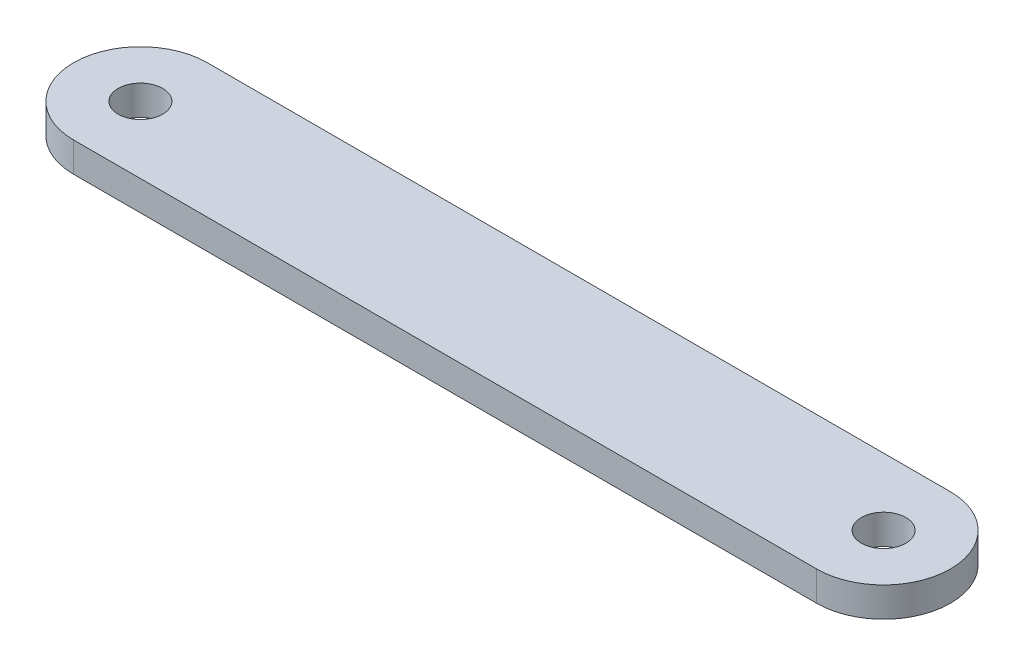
ISO-10303-21;
HEADER;
FILE_DESCRIPTION(('STEP AP214'),'2;1');
FILE_NAME('part.step','',(''),(''),'','','');
FILE_SCHEMA(('AUTOMOTIVE_DESIGN { 1 0 10303 214 1 1 1 1 }'));
ENDSEC;
DATA;
#1=APPLICATION_CONTEXT('core data for automotive mechanical design processes');
#2=APPLICATION_PROTOCOL_DEFINITION('international standard','automotive_design',2000,#1);
#3=PRODUCT_CONTEXT('',#1,'mechanical');
#4=PRODUCT('Part','Part','',(#3));
#5=PRODUCT_RELATED_PRODUCT_CATEGORY('part','',(#4));
#6=PRODUCT_DEFINITION_FORMATION('','',#4);
#7=PRODUCT_DEFINITION_CONTEXT('part definition',#1,'design');
#8=PRODUCT_DEFINITION('design','',#6,#7);
#9=PRODUCT_DEFINITION_SHAPE('','',#8);
#10=(LENGTH_UNIT() NAMED_UNIT(*) SI_UNIT(.MILLI.,.METRE.));
#11=(NAMED_UNIT(*) PLANE_ANGLE_UNIT() SI_UNIT($,.RADIAN.));
#12=(NAMED_UNIT(*) SI_UNIT($,.STERADIAN.) SOLID_ANGLE_UNIT());
#13=UNCERTAINTY_MEASURE_WITH_UNIT(LENGTH_MEASURE(1.E-05),#10,'distance_accuracy_value','');
#14=(GEOMETRIC_REPRESENTATION_CONTEXT(3) GLOBAL_UNCERTAINTY_ASSIGNED_CONTEXT((#13)) GLOBAL_UNIT_ASSIGNED_CONTEXT((#10,
#11,#12)) REPRESENTATION_CONTEXT('',''));
#15=CARTESIAN_POINT('',(0.,0.,0.));
#16=DIRECTION('',(0.,0.,1.));
#17=DIRECTION('',(1.,0.,0.));
#18=AXIS2_PLACEMENT_3D('',#15,#16,#17);
#19=CARTESIAN_POINT('',(25.,2.,0.));
#20=DIRECTION('',(0.,-1.,0.));
#21=DIRECTION('',(0.,0.,-1.));
#22=AXIS2_PLACEMENT_3D('',#19,#20,#21);
#23=CYLINDRICAL_SURFACE('',#22,4.5);
#24=CARTESIAN_POINT('',(25.,0.,0.));
#25=DIRECTION('',(0.,1.,0.));
#26=DIRECTION('',(0.,0.,-1.));
#27=AXIS2_PLACEMENT_3D('',#24,#25,#26);
#28=CIRCLE('',#27,4.5);
#29=CARTESIAN_POINT('',(25.,0.,4.5));
#30=VERTEX_POINT('',#29);
#31=CARTESIAN_POINT('',(25.,0.,-4.5));
#32=VERTEX_POINT('',#31);
#33=EDGE_CURVE('E118',#30,#32,#28,.T.);
#34=ORIENTED_EDGE('',*,*,#33,.T.);
#35=DIRECTION('',(0.,-1.,0.));
#36=VECTOR('',#35,1.);
#37=CARTESIAN_POINT('',(25.,2.,-4.5));
#38=LINE('',#37,#36);
#39=CARTESIAN_POINT('',(25.,2.,-4.5));
#40=VERTEX_POINT('',#39);
#41=EDGE_CURVE('E13',#40,#32,#38,.T.);
#42=ORIENTED_EDGE('',*,*,#41,.F.);
#43=CARTESIAN_POINT('',(25.,2.,0.));
#44=DIRECTION('',(0.,1.,0.));
#45=DIRECTION('',(0.,0.,-1.));
#46=AXIS2_PLACEMENT_3D('',#43,#44,#45);
#47=CIRCLE('',#46,4.5);
#48=CARTESIAN_POINT('',(25.,2.,4.5));
#49=VERTEX_POINT('',#48);
#50=EDGE_CURVE('E102',#49,#40,#47,.T.);
#51=ORIENTED_EDGE('',*,*,#50,.F.);
#52=DIRECTION('',(0.,-1.,0.));
#53=VECTOR('',#52,1.);
#54=CARTESIAN_POINT('',(25.,2.,4.5));
#55=LINE('',#54,#53);
#56=EDGE_CURVE('E114',#49,#30,#55,.T.);
#57=ORIENTED_EDGE('',*,*,#56,.T.);
#58=EDGE_LOOP('',(#34,#42,#51,#57));
#59=FACE_BOUND('',#58,.T.);
#60=ADVANCED_FACE('F50',(#59),#23,.T.);
#61=CARTESIAN_POINT('',(-25.,2.,-4.5));
#62=DIRECTION('',(0.,0.,1.));
#63=DIRECTION('',(1.,0.,0.));
#64=AXIS2_PLACEMENT_3D('',#61,#62,#63);
#65=PLANE('',#64);
#66=DIRECTION('',(-1.,0.,0.));
#67=VECTOR('',#66,1.);
#68=CARTESIAN_POINT('',(-25.,0.,-4.5));
#69=LINE('',#68,#67);
#70=CARTESIAN_POINT('',(-25.,0.,-4.5));
#71=VERTEX_POINT('',#70);
#72=EDGE_CURVE('E107',#32,#71,#69,.T.);
#73=ORIENTED_EDGE('',*,*,#72,.T.);
#74=DIRECTION('',(0.,-1.,0.));
#75=VECTOR('',#74,1.);
#76=CARTESIAN_POINT('',(-25.,2.,-4.5));
#77=LINE('',#76,#75);
#78=CARTESIAN_POINT('',(-25.,2.,-4.5));
#79=VERTEX_POINT('',#78);
#80=EDGE_CURVE('E59',#79,#71,#77,.T.);
#81=ORIENTED_EDGE('',*,*,#80,.F.);
#82=DIRECTION('',(-1.,0.,0.));
#83=VECTOR('',#82,1.);
#84=CARTESIAN_POINT('',(-25.,2.,-4.5));
#85=LINE('',#84,#83);
#86=EDGE_CURVE('E97',#40,#79,#85,.T.);
#87=ORIENTED_EDGE('',*,*,#86,.F.);
#88=ORIENTED_EDGE('',*,*,#41,.T.);
#89=EDGE_LOOP('',(#73,#81,#87,#88));
#90=FACE_BOUND('',#89,.T.);
#91=ADVANCED_FACE('F106',(#90),#65,.F.);
#92=CARTESIAN_POINT('',(-25.,2.,0.));
#93=DIRECTION('',(0.,-1.,0.));
#94=DIRECTION('',(0.,0.,-1.));
#95=AXIS2_PLACEMENT_3D('',#92,#93,#94);
#96=CYLINDRICAL_SURFACE('',#95,4.5);
#97=CARTESIAN_POINT('',(-25.,0.,0.));
#98=DIRECTION('',(0.,1.,0.));
#99=DIRECTION('',(0.,0.,1.));
#100=AXIS2_PLACEMENT_3D('',#97,#98,#99);
#101=CIRCLE('',#100,4.5);
#102=CARTESIAN_POINT('',(-25.,0.,4.5));
#103=VERTEX_POINT('',#102);
#104=EDGE_CURVE('E84',#71,#103,#101,.T.);
#105=ORIENTED_EDGE('',*,*,#104,.T.);
#106=DIRECTION('',(0.,-1.,0.));
#107=VECTOR('',#106,1.);
#108=CARTESIAN_POINT('',(-25.,2.,4.5));
#109=LINE('',#108,#107);
#110=CARTESIAN_POINT('',(-25.,2.,4.5));
#111=VERTEX_POINT('',#110);
#112=EDGE_CURVE('E109',#111,#103,#109,.T.);
#113=ORIENTED_EDGE('',*,*,#112,.F.);
#114=CARTESIAN_POINT('',(-25.,2.,0.));
#115=DIRECTION('',(0.,1.,0.));
#116=DIRECTION('',(0.,0.,1.));
#117=AXIS2_PLACEMENT_3D('',#114,#115,#116);
#118=CIRCLE('',#117,4.5);
#119=EDGE_CURVE('E100',#79,#111,#118,.T.);
#120=ORIENTED_EDGE('',*,*,#119,.F.);
#121=ORIENTED_EDGE('',*,*,#80,.T.);
#122=EDGE_LOOP('',(#105,#113,#120,#121));
#123=FACE_BOUND('',#122,.T.);
#124=ADVANCED_FACE('F110',(#123),#96,.T.);
#125=CARTESIAN_POINT('',(-25.,2.,4.5));
#126=DIRECTION('',(0.,0.,-1.));
#127=DIRECTION('',(-1.,0.,0.));
#128=AXIS2_PLACEMENT_3D('',#125,#126,#127);
#129=PLANE('',#128);
#130=DIRECTION('',(1.,0.,0.));
#131=VECTOR('',#130,1.);
#132=CARTESIAN_POINT('',(-25.,0.,4.5));
#133=LINE('',#132,#131);
#134=EDGE_CURVE('E90',#103,#30,#133,.T.);
#135=ORIENTED_EDGE('',*,*,#134,.T.);
#136=ORIENTED_EDGE('',*,*,#56,.F.);
#137=DIRECTION('',(1.,0.,0.));
#138=VECTOR('',#137,1.);
#139=CARTESIAN_POINT('',(-25.,2.,4.5));
#140=LINE('',#139,#138);
#141=EDGE_CURVE('E67',#111,#49,#140,.T.);
#142=ORIENTED_EDGE('',*,*,#141,.F.);
#143=ORIENTED_EDGE('',*,*,#112,.T.);
#144=EDGE_LOOP('',(#135,#136,#142,#143));
#145=FACE_BOUND('',#144,.T.);
#146=ADVANCED_FACE('F132',(#145),#129,.F.);
#147=CARTESIAN_POINT('',(25.,2.,0.));
#148=DIRECTION('',(0.,-1.,0.));
#149=DIRECTION('',(0.,0.,-1.));
#150=AXIS2_PLACEMENT_3D('',#147,#148,#149);
#151=PLANE('',#150);
#152=CARTESIAN_POINT('',(-25.,2.,0.));
#153=DIRECTION('',(0.,1.,0.));
#154=DIRECTION('',(0.,0.,1.));
#155=AXIS2_PLACEMENT_3D('',#152,#153,#154);
#156=CIRCLE('',#155,1.5);
#157=CARTESIAN_POINT('',(-25.,2.,1.5));
#158=VERTEX_POINT('',#157);
#159=EDGE_CURVE('E147',#158,#158,#156,.T.);
#160=ORIENTED_EDGE('',*,*,#159,.F.);
#161=EDGE_LOOP('',(#160));
#162=FACE_BOUND('',#161,.T.);
#163=CARTESIAN_POINT('',(25.,2.,0.));
#164=DIRECTION('',(0.,1.,0.));
#165=DIRECTION('',(0.,0.,1.));
#166=AXIS2_PLACEMENT_3D('',#163,#164,#165);
#167=CIRCLE('',#166,1.5);
#168=CARTESIAN_POINT('',(25.,2.,1.5));
#169=VERTEX_POINT('',#168);
#170=EDGE_CURVE('E139',#169,#169,#167,.T.);
#171=ORIENTED_EDGE('',*,*,#170,.F.);
#172=EDGE_LOOP('',(#171));
#173=FACE_BOUND('',#172,.T.);
#174=ORIENTED_EDGE('',*,*,#50,.T.);
#175=ORIENTED_EDGE('',*,*,#86,.T.);
#176=ORIENTED_EDGE('',*,*,#119,.T.);
#177=ORIENTED_EDGE('',*,*,#141,.T.);
#178=EDGE_LOOP('',(#174,#175,#176,#177));
#179=FACE_BOUND('',#178,.T.);
#180=ADVANCED_FACE('F98',(#162,#173,#179),#151,.F.);
#181=CARTESIAN_POINT('',(25.,0.,0.));
#182=DIRECTION('',(0.,-1.,0.));
#183=DIRECTION('',(0.,0.,-1.));
#184=AXIS2_PLACEMENT_3D('',#181,#182,#183);
#185=PLANE('',#184);
#186=CARTESIAN_POINT('',(-25.,0.,0.));
#187=DIRECTION('',(0.,1.,0.));
#188=DIRECTION('',(0.,0.,1.));
#189=AXIS2_PLACEMENT_3D('',#186,#187,#188);
#190=CIRCLE('',#189,1.5);
#191=CARTESIAN_POINT('',(-25.,0.,1.5));
#192=VERTEX_POINT('',#191);
#193=EDGE_CURVE('E122',#192,#192,#190,.T.);
#194=ORIENTED_EDGE('',*,*,#193,.T.);
#195=EDGE_LOOP('',(#194));
#196=FACE_BOUND('',#195,.T.);
#197=CARTESIAN_POINT('',(25.,0.,0.));
#198=DIRECTION('',(0.,1.,0.));
#199=DIRECTION('',(0.,0.,1.));
#200=AXIS2_PLACEMENT_3D('',#197,#198,#199);
#201=CIRCLE('',#200,1.5);
#202=CARTESIAN_POINT('',(25.,0.,1.5));
#203=VERTEX_POINT('',#202);
#204=EDGE_CURVE('E143',#203,#203,#201,.T.);
#205=ORIENTED_EDGE('',*,*,#204,.T.);
#206=EDGE_LOOP('',(#205));
#207=FACE_BOUND('',#206,.T.);
#208=ORIENTED_EDGE('',*,*,#33,.F.);
#209=ORIENTED_EDGE('',*,*,#134,.F.);
#210=ORIENTED_EDGE('',*,*,#104,.F.);
#211=ORIENTED_EDGE('',*,*,#72,.F.);
#212=EDGE_LOOP('',(#208,#209,#210,#211));
#213=FACE_BOUND('',#212,.T.);
#214=ADVANCED_FACE('F135',(#196,#207,#213),#185,.T.);
#215=CARTESIAN_POINT('',(25.,0.,0.));
#216=DIRECTION('',(0.,1.,0.));
#217=DIRECTION('',(0.,0.,1.));
#218=AXIS2_PLACEMENT_3D('',#215,#216,#217);
#219=CYLINDRICAL_SURFACE('',#218,1.5);
#220=ORIENTED_EDGE('',*,*,#204,.F.);
#221=EDGE_LOOP('',(#220));
#222=FACE_BOUND('',#221,.T.);
#223=ORIENTED_EDGE('',*,*,#170,.T.);
#224=EDGE_LOOP('',(#223));
#225=FACE_BOUND('',#224,.T.);
#226=ADVANCED_FACE('F160',(#222,#225),#219,.F.);
#227=CARTESIAN_POINT('',(-25.,0.,0.));
#228=DIRECTION('',(0.,1.,0.));
#229=DIRECTION('',(0.,0.,1.));
#230=AXIS2_PLACEMENT_3D('',#227,#228,#229);
#231=CYLINDRICAL_SURFACE('',#230,1.5);
#232=ORIENTED_EDGE('',*,*,#193,.F.);
#233=EDGE_LOOP('',(#232));
#234=FACE_BOUND('',#233,.T.);
#235=ORIENTED_EDGE('',*,*,#159,.T.);
#236=EDGE_LOOP('',(#235));
#237=FACE_BOUND('',#236,.T.);
#238=ADVANCED_FACE('F157',(#234,#237),#231,.F.);
#239=CLOSED_SHELL('',(#60,#91,#124,#146,#180,#214,#226,#238));
#240=MANIFOLD_SOLID_BREP('B2',#239);
#241=ADVANCED_BREP_SHAPE_REPRESENTATION('',(#18,#240),#14);
#242=SHAPE_DEFINITION_REPRESENTATION(#9,#241);
ENDSEC;
END-ISO-10303-21;
